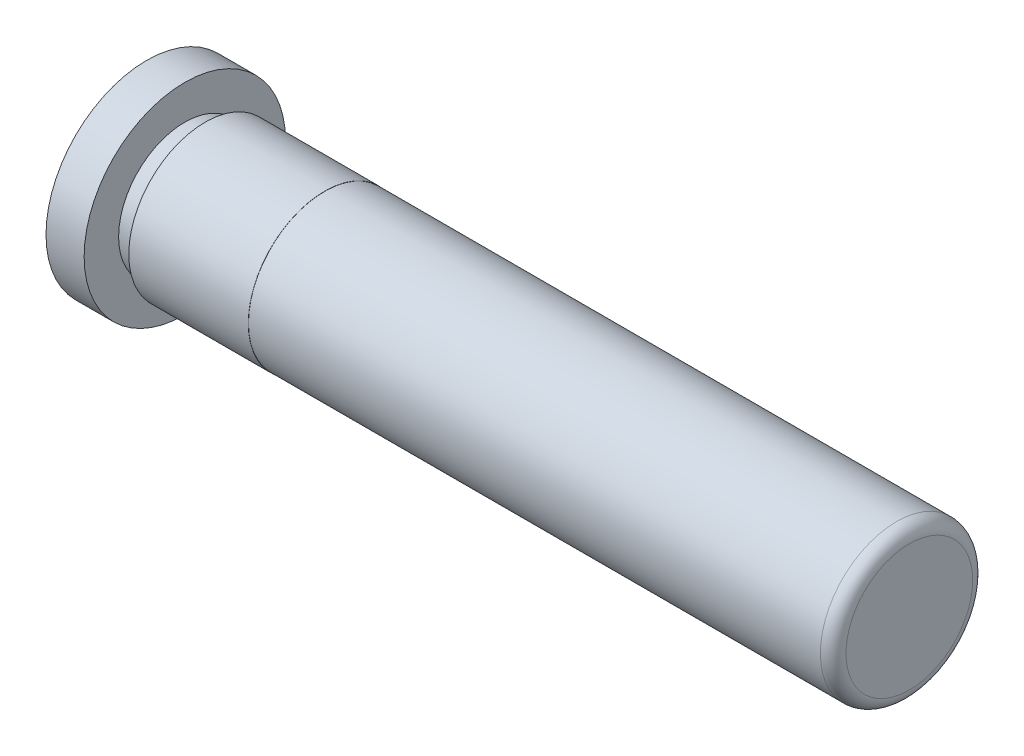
ISO-10303-21;
HEADER;
FILE_DESCRIPTION(('STEP AP214'),'2;1');
FILE_NAME('part.step','',(''),(''),'','','');
FILE_SCHEMA(('AUTOMOTIVE_DESIGN { 1 0 10303 214 1 1 1 1 }'));
ENDSEC;
DATA;
#1=APPLICATION_CONTEXT('core data for automotive mechanical design processes');
#2=APPLICATION_PROTOCOL_DEFINITION('international standard','automotive_design',2000,#1);
#3=PRODUCT_CONTEXT('',#1,'mechanical');
#4=PRODUCT('Part','Part','',(#3));
#5=PRODUCT_RELATED_PRODUCT_CATEGORY('part','',(#4));
#6=PRODUCT_DEFINITION_FORMATION('','',#4);
#7=PRODUCT_DEFINITION_CONTEXT('part definition',#1,'design');
#8=PRODUCT_DEFINITION('design','',#6,#7);
#9=PRODUCT_DEFINITION_SHAPE('','',#8);
#10=(LENGTH_UNIT() NAMED_UNIT(*) SI_UNIT(.MILLI.,.METRE.));
#11=(NAMED_UNIT(*) PLANE_ANGLE_UNIT() SI_UNIT($,.RADIAN.));
#12=(NAMED_UNIT(*) SI_UNIT($,.STERADIAN.) SOLID_ANGLE_UNIT());
#13=UNCERTAINTY_MEASURE_WITH_UNIT(LENGTH_MEASURE(1.E-05),#10,'distance_accuracy_value','');
#14=(GEOMETRIC_REPRESENTATION_CONTEXT(3) GLOBAL_UNCERTAINTY_ASSIGNED_CONTEXT((#13)) GLOBAL_UNIT_ASSIGNED_CONTEXT((#10,
#11,#12)) REPRESENTATION_CONTEXT('',''));
#15=CARTESIAN_POINT('',(0.,0.,0.));
#16=DIRECTION('',(0.,0.,1.));
#17=DIRECTION('',(1.,0.,0.));
#18=AXIS2_PLACEMENT_3D('',#15,#16,#17);
#19=CARTESIAN_POINT('',(2.54,8.255,0.));
#20=DIRECTION('',(-1.,0.,0.));
#21=DIRECTION('',(0.,0.,1.));
#22=AXIS2_PLACEMENT_3D('',#19,#20,#21);
#23=PLANE('',#22);
#24=CARTESIAN_POINT('',(2.54,-0.0127000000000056,0.));
#25=DIRECTION('',(-1.,0.,0.));
#26=DIRECTION('',(0.,0.,1.));
#27=AXIS2_PLACEMENT_3D('',#24,#25,#26);
#28=CIRCLE('',#27,9.5377);
#29=CARTESIAN_POINT('',(2.54,-0.0127000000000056,9.5377));
#30=VERTEX_POINT('',#29);
#31=EDGE_CURVE('E41',#30,#30,#28,.T.);
#32=ORIENTED_EDGE('',*,*,#31,.T.);
#33=EDGE_LOOP('',(#32));
#34=FACE_BOUND('',#33,.T.);
#35=CARTESIAN_POINT('',(2.54,-0.0127000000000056,0.));
#36=DIRECTION('',(-1.,0.,0.));
#37=DIRECTION('',(0.,0.,1.));
#38=AXIS2_PLACEMENT_3D('',#35,#36,#37);
#39=CIRCLE('',#38,8.2677);
#40=CARTESIAN_POINT('',(2.54,-0.0127000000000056,8.2677));
#41=VERTEX_POINT('',#40);
#42=EDGE_CURVE('E62',#41,#41,#39,.T.);
#43=ORIENTED_EDGE('',*,*,#42,.F.);
#44=EDGE_LOOP('',(#43));
#45=FACE_BOUND('',#44,.T.);
#46=ADVANCED_FACE('F30',(#34,#45),#23,.T.);
#47=CARTESIAN_POINT('',(-4.76250000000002,-0.0127000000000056,0.));
#48=DIRECTION('',(-1.,0.,0.));
#49=DIRECTION('',(0.,0.,1.));
#50=AXIS2_PLACEMENT_3D('',#47,#48,#49);
#51=CYLINDRICAL_SURFACE('',#50,9.5377);
#52=CARTESIAN_POINT('',(17.4625,-0.0127000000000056,0.));
#53=DIRECTION('',(-1.,0.,0.));
#54=DIRECTION('',(0.,0.,1.));
#55=AXIS2_PLACEMENT_3D('',#52,#53,#54);
#56=CIRCLE('',#55,9.5377);
#57=CARTESIAN_POINT('',(17.4625,-0.0127000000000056,9.5377));
#58=VERTEX_POINT('',#57);
#59=EDGE_CURVE('E45',#58,#58,#56,.T.);
#60=ORIENTED_EDGE('',*,*,#59,.T.);
#61=EDGE_LOOP('',(#60));
#62=FACE_BOUND('',#61,.T.);
#63=ORIENTED_EDGE('',*,*,#31,.F.);
#64=EDGE_LOOP('',(#63));
#65=FACE_BOUND('',#64,.T.);
#66=ADVANCED_FACE('F70',(#62,#65),#51,.T.);
#67=CARTESIAN_POINT('',(17.4625,9.4996,0.));
#68=DIRECTION('',(-1.,0.,0.));
#69=DIRECTION('',(0.,0.,1.));
#70=AXIS2_PLACEMENT_3D('',#67,#68,#69);
#71=PLANE('',#70);
#72=ORIENTED_EDGE('',*,*,#59,.F.);
#73=EDGE_LOOP('',(#72));
#74=FACE_BOUND('',#73,.T.);
#75=CARTESIAN_POINT('',(17.4625,-0.0127000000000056,0.));
#76=DIRECTION('',(-1.,0.,0.));
#77=DIRECTION('',(0.,0.,1.));
#78=AXIS2_PLACEMENT_3D('',#75,#76,#77);
#79=CIRCLE('',#78,9.5123);
#80=CARTESIAN_POINT('',(17.4625,-0.0127000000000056,9.5123));
#81=VERTEX_POINT('',#80);
#82=EDGE_CURVE('E50',#81,#81,#79,.T.);
#83=ORIENTED_EDGE('',*,*,#82,.T.);
#84=EDGE_LOOP('',(#83));
#85=FACE_BOUND('',#84,.T.);
#86=ADVANCED_FACE('F75',(#74,#85),#71,.F.);
#87=CARTESIAN_POINT('',(-4.76250000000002,-0.0127000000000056,0.));
#88=DIRECTION('',(-1.,0.,0.));
#89=DIRECTION('',(0.,0.,1.));
#90=AXIS2_PLACEMENT_3D('',#87,#88,#89);
#91=CYLINDRICAL_SURFACE('',#90,9.5123);
#92=CARTESIAN_POINT('',(88.8873,-0.0127000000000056,0.));
#93=DIRECTION('',(1.,0.,0.));
#94=DIRECTION('',(0.,0.,-1.));
#95=AXIS2_PLACEMENT_3D('',#92,#93,#94);
#96=CIRCLE('',#95,9.5123);
#97=CARTESIAN_POINT('',(88.8873,-0.0127000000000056,-9.5123));
#98=VERTEX_POINT('',#97);
#99=EDGE_CURVE('E37',#98,#98,#96,.F.);
#100=ORIENTED_EDGE('',*,*,#99,.T.);
#101=EDGE_LOOP('',(#100));
#102=FACE_BOUND('',#101,.T.);
#103=ORIENTED_EDGE('',*,*,#82,.F.);
#104=EDGE_LOOP('',(#103));
#105=FACE_BOUND('',#104,.T.);
#106=ADVANCED_FACE('F81',(#102,#105),#91,.T.);
#107=CARTESIAN_POINT('',(90.4875,9.49959999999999,0.));
#108=DIRECTION('',(1.,0.,0.));
#109=DIRECTION('',(0.,0.,-1.));
#110=AXIS2_PLACEMENT_3D('',#107,#108,#109);
#111=PLANE('',#110);
#112=CARTESIAN_POINT('',(90.4875,-0.0127000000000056,0.));
#113=DIRECTION('',(1.,0.,0.));
#114=DIRECTION('',(0.,0.,-1.));
#115=AXIS2_PLACEMENT_3D('',#112,#113,#114);
#116=CIRCLE('',#115,7.9121);
#117=CARTESIAN_POINT('',(90.4875,-0.0127000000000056,-7.9121));
#118=VERTEX_POINT('',#117);
#119=EDGE_CURVE('E10',#118,#118,#116,.T.);
#120=ORIENTED_EDGE('',*,*,#119,.T.);
#121=EDGE_LOOP('',(#120));
#122=FACE_BOUND('',#121,.T.);
#123=ADVANCED_FACE('F85',(#122),#111,.T.);
#124=CARTESIAN_POINT('',(-4.76250000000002,-0.0127000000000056,0.));
#125=DIRECTION('',(-1.,0.,0.));
#126=DIRECTION('',(0.,0.,1.));
#127=AXIS2_PLACEMENT_3D('',#124,#125,#126);
#128=PLANE('',#127);
#129=CARTESIAN_POINT('',(-4.76250000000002,-0.0127000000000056,0.));
#130=DIRECTION('',(-1.,0.,0.));
#131=DIRECTION('',(0.,0.,1.));
#132=AXIS2_PLACEMENT_3D('',#129,#130,#131);
#133=CIRCLE('',#132,12.573);
#134=CARTESIAN_POINT('',(-4.76250000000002,-0.0127000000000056,12.573));
#135=VERTEX_POINT('',#134);
#136=EDGE_CURVE('E53',#135,#135,#133,.T.);
#137=ORIENTED_EDGE('',*,*,#136,.T.);
#138=EDGE_LOOP('',(#137));
#139=FACE_BOUND('',#138,.T.);
#140=ADVANCED_FACE('F88',(#139),#128,.T.);
#141=CARTESIAN_POINT('',(-4.76250000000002,-0.0127000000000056,0.));
#142=DIRECTION('',(-1.,0.,0.));
#143=DIRECTION('',(0.,0.,1.));
#144=AXIS2_PLACEMENT_3D('',#141,#142,#143);
#145=CYLINDRICAL_SURFACE('',#144,12.573);
#146=CARTESIAN_POINT('',(0.,-0.0127000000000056,0.));
#147=DIRECTION('',(-1.,0.,0.));
#148=DIRECTION('',(0.,0.,1.));
#149=AXIS2_PLACEMENT_3D('',#146,#147,#148);
#150=CIRCLE('',#149,12.573);
#151=CARTESIAN_POINT('',(0.,-0.0127000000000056,12.573));
#152=VERTEX_POINT('',#151);
#153=EDGE_CURVE('E56',#152,#152,#150,.T.);
#154=ORIENTED_EDGE('',*,*,#153,.T.);
#155=EDGE_LOOP('',(#154));
#156=FACE_BOUND('',#155,.T.);
#157=ORIENTED_EDGE('',*,*,#136,.F.);
#158=EDGE_LOOP('',(#157));
#159=FACE_BOUND('',#158,.T.);
#160=ADVANCED_FACE('F91',(#156,#159),#145,.T.);
#161=CARTESIAN_POINT('',(0.,12.5603,0.));
#162=DIRECTION('',(1.,0.,0.));
#163=DIRECTION('',(0.,0.,-1.));
#164=AXIS2_PLACEMENT_3D('',#161,#162,#163);
#165=PLANE('',#164);
#166=CARTESIAN_POINT('',(0.,-0.0127000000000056,0.));
#167=DIRECTION('',(-1.,0.,0.));
#168=DIRECTION('',(0.,0.,1.));
#169=AXIS2_PLACEMENT_3D('',#166,#167,#168);
#170=CIRCLE('',#169,8.2677);
#171=CARTESIAN_POINT('',(0.,-0.0127000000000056,8.2677));
#172=VERTEX_POINT('',#171);
#173=EDGE_CURVE('E59',#172,#172,#170,.T.);
#174=ORIENTED_EDGE('',*,*,#173,.T.);
#175=EDGE_LOOP('',(#174));
#176=FACE_BOUND('',#175,.T.);
#177=ORIENTED_EDGE('',*,*,#153,.F.);
#178=EDGE_LOOP('',(#177));
#179=FACE_BOUND('',#178,.T.);
#180=ADVANCED_FACE('F95',(#176,#179),#165,.T.);
#181=CARTESIAN_POINT('',(-4.76250000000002,-0.0127000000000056,0.));
#182=DIRECTION('',(-1.,0.,0.));
#183=DIRECTION('',(0.,0.,1.));
#184=AXIS2_PLACEMENT_3D('',#181,#182,#183);
#185=CYLINDRICAL_SURFACE('',#184,8.2677);
#186=ORIENTED_EDGE('',*,*,#42,.T.);
#187=EDGE_LOOP('',(#186));
#188=FACE_BOUND('',#187,.T.);
#189=ORIENTED_EDGE('',*,*,#173,.F.);
#190=EDGE_LOOP('',(#189));
#191=FACE_BOUND('',#190,.T.);
#192=ADVANCED_FACE('F66',(#188,#191),#185,.T.);
#193=CARTESIAN_POINT('',(88.8873,-0.0127000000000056,0.));
#194=DIRECTION('',(1.,0.,0.));
#195=DIRECTION('',(0.,0.,-1.));
#196=AXIS2_PLACEMENT_3D('',#193,#194,#195);
#197=TOROIDAL_SURFACE('',#196,7.9121,1.6002);
#198=ORIENTED_EDGE('',*,*,#119,.F.);
#199=EDGE_LOOP('',(#198));
#200=FACE_BOUND('',#199,.T.);
#201=ORIENTED_EDGE('',*,*,#99,.F.);
#202=EDGE_LOOP('',(#201));
#203=FACE_BOUND('',#202,.T.);
#204=ADVANCED_FACE('F32',(#200,#203),#197,.T.);
#205=CLOSED_SHELL('',(#46,#66,#86,#106,#123,#140,#160,#180,#192,#204));
#206=MANIFOLD_SOLID_BREP('B2',#205);
#207=ADVANCED_BREP_SHAPE_REPRESENTATION('',(#18,#206),#14);
#208=SHAPE_DEFINITION_REPRESENTATION(#9,#207);
ENDSEC;
END-ISO-10303-21;
